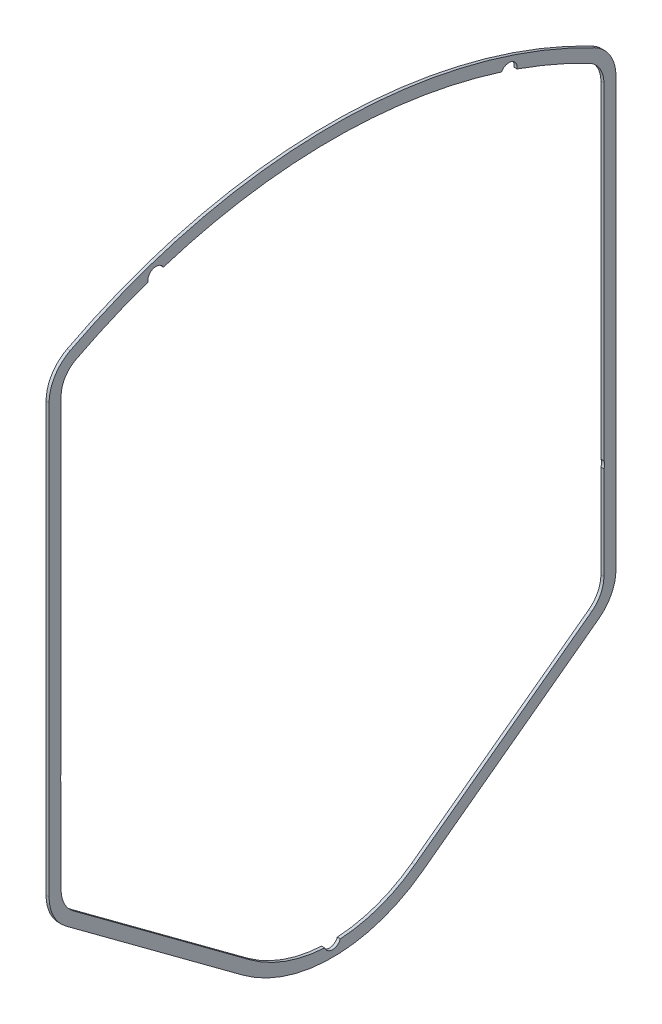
ISO-10303-21;
HEADER;
FILE_DESCRIPTION(('STEP AP214'),'2;1');
FILE_NAME('part.step','',(''),(''),'','','');
FILE_SCHEMA(('AUTOMOTIVE_DESIGN { 1 0 10303 214 1 1 1 1 }'));
ENDSEC;
DATA;
#1=APPLICATION_CONTEXT('core data for automotive mechanical design processes');
#2=APPLICATION_PROTOCOL_DEFINITION('international standard','automotive_design',2000,#1);
#3=PRODUCT_CONTEXT('',#1,'mechanical');
#4=PRODUCT('Part','Part','',(#3));
#5=PRODUCT_RELATED_PRODUCT_CATEGORY('part','',(#4));
#6=PRODUCT_DEFINITION_FORMATION('','',#4);
#7=PRODUCT_DEFINITION_CONTEXT('part definition',#1,'design');
#8=PRODUCT_DEFINITION('design','',#6,#7);
#9=PRODUCT_DEFINITION_SHAPE('','',#8);
#10=(LENGTH_UNIT() NAMED_UNIT(*) SI_UNIT(.MILLI.,.METRE.));
#11=(NAMED_UNIT(*) PLANE_ANGLE_UNIT() SI_UNIT($,.RADIAN.));
#12=(NAMED_UNIT(*) SI_UNIT($,.STERADIAN.) SOLID_ANGLE_UNIT());
#13=UNCERTAINTY_MEASURE_WITH_UNIT(LENGTH_MEASURE(1.E-05),#10,'distance_accuracy_value','');
#14=(GEOMETRIC_REPRESENTATION_CONTEXT(3) GLOBAL_UNCERTAINTY_ASSIGNED_CONTEXT((#13)) GLOBAL_UNIT_ASSIGNED_CONTEXT((#10,
#11,#12)) REPRESENTATION_CONTEXT('',''));
#15=CARTESIAN_POINT('',(0.,0.,0.));
#16=DIRECTION('',(0.,0.,1.));
#17=DIRECTION('',(1.,0.,0.));
#18=AXIS2_PLACEMENT_3D('',#15,#16,#17);
#19=CARTESIAN_POINT('',(1.,156.2529999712,80.9999999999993));
#20=DIRECTION('',(1.,0.,0.));
#21=DIRECTION('',(0.,0.,-1.));
#22=AXIS2_PLACEMENT_3D('',#19,#20,#21);
#23=PLANE('',#22);
#24=CARTESIAN_POINT('',(1.,156.2529999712,80.9999999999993));
#25=DIRECTION('',(1.,0.,0.));
#26=DIRECTION('',(0.,0.,-1.));
#27=AXIS2_PLACEMENT_3D('',#24,#25,#26);
#28=CIRCLE('',#27,13.);
#29=CARTESIAN_POINT('',(1.,167.7944147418,86.9829545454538));
#30=VERTEX_POINT('',#29);
#31=CARTESIAN_POINT('',(1.,156.2529999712,93.9999999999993));
#32=VERTEX_POINT('',#31);
#33=EDGE_CURVE('E392',#30,#32,#28,.T.);
#34=ORIENTED_EDGE('',*,*,#33,.T.);
#35=DIRECTION('',(0.,-1.,0.));
#36=VECTOR('',#35,1.);
#37=CARTESIAN_POINT('',(1.,14.4127935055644,93.9999999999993));
#38=LINE('',#37,#36);
#39=CARTESIAN_POINT('',(1.,14.4127935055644,93.9999999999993));
#40=VERTEX_POINT('',#39);
#41=EDGE_CURVE('E395',#32,#40,#38,.T.);
#42=ORIENTED_EDGE('',*,*,#41,.T.);
#43=CARTESIAN_POINT('',(1.,14.4127935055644,79.9999999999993));
#44=DIRECTION('',(1.,0.,0.));
#45=DIRECTION('',(0.,0.,-1.));
#46=AXIS2_PLACEMENT_3D('',#43,#44,#45);
#47=CIRCLE('',#46,14.);
#48=CARTESIAN_POINT('',(1.,3.15879745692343,88.3275190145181));
#49=VERTEX_POINT('',#48);
#50=EDGE_CURVE('E397',#40,#49,#47,.T.);
#51=ORIENTED_EDGE('',*,*,#50,.T.);
#52=DIRECTION('',(0.,-0.594822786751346,-0.803856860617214));
#53=VECTOR('',#52,1.);
#54=CARTESIAN_POINT('',(1.,-40.1928430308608,29.7411393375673));
#55=LINE('',#54,#53);
#56=CARTESIAN_POINT('',(1.,-40.1928430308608,29.7411393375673));
#57=VERTEX_POINT('',#56);
#58=EDGE_CURVE('E399',#49,#57,#55,.T.);
#59=ORIENTED_EDGE('',*,*,#58,.T.);
#60=CARTESIAN_POINT('',(1.,0.,0.));
#61=DIRECTION('',(1.,0.,0.));
#62=DIRECTION('',(0.,0.,-1.));
#63=AXIS2_PLACEMENT_3D('',#60,#61,#62);
#64=CIRCLE('',#63,50.);
#65=CARTESIAN_POINT('',(1.,-40.1928430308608,-29.7411393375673));
#66=VERTEX_POINT('',#65);
#67=EDGE_CURVE('E401',#57,#66,#64,.T.);
#68=ORIENTED_EDGE('',*,*,#67,.T.);
#69=DIRECTION('',(0.,0.594822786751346,-0.803856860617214));
#70=VECTOR('',#69,1.);
#71=CARTESIAN_POINT('',(1.,-40.1928430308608,-29.7411393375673));
#72=LINE('',#71,#70);
#73=CARTESIAN_POINT('',(1.,3.15879745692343,-88.3275190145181));
#74=VERTEX_POINT('',#73);
#75=EDGE_CURVE('E403',#66,#74,#72,.T.);
#76=ORIENTED_EDGE('',*,*,#75,.T.);
#77=CARTESIAN_POINT('',(1.,14.4127935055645,-79.9999999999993));
#78=DIRECTION('',(1.,0.,0.));
#79=DIRECTION('',(0.,0.,-1.));
#80=AXIS2_PLACEMENT_3D('',#77,#78,#79);
#81=CIRCLE('',#80,14.);
#82=CARTESIAN_POINT('',(1.,14.4127935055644,-93.9999999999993));
#83=VERTEX_POINT('',#82);
#84=EDGE_CURVE('E405',#74,#83,#81,.T.);
#85=ORIENTED_EDGE('',*,*,#84,.T.);
#86=DIRECTION('',(0.,1.,0.));
#87=VECTOR('',#86,1.);
#88=CARTESIAN_POINT('',(1.,14.4127935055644,-93.9999999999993));
#89=LINE('',#88,#87);
#90=CARTESIAN_POINT('',(1.,156.2529999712,-93.9999999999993));
#91=VERTEX_POINT('',#90);
#92=EDGE_CURVE('E407',#83,#91,#89,.T.);
#93=ORIENTED_EDGE('',*,*,#92,.T.);
#94=CARTESIAN_POINT('',(1.,156.2529999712,-80.9999999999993));
#95=DIRECTION('',(1.,0.,0.));
#96=DIRECTION('',(0.,0.,-1.));
#97=AXIS2_PLACEMENT_3D('',#94,#95,#96);
#98=CIRCLE('',#97,13.);
#99=CARTESIAN_POINT('',(1.,167.7944147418,-86.9829545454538));
#100=VERTEX_POINT('',#99);
#101=EDGE_CURVE('E409',#91,#100,#98,.T.);
#102=ORIENTED_EDGE('',*,*,#101,.T.);
#103=CARTESIAN_POINT('',(1.,0.,0.));
#104=DIRECTION('',(1.,0.,0.));
#105=DIRECTION('',(0.,0.,-1.));
#106=AXIS2_PLACEMENT_3D('',#103,#104,#105);
#107=CIRCLE('',#106,188.999999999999);
#108=EDGE_CURVE('E411',#100,#30,#107,.T.);
#109=ORIENTED_EDGE('',*,*,#108,.T.);
#110=EDGE_LOOP('',(#34,#42,#51,#59,#68,#76,#85,#93,#102,#109));
#111=FACE_BOUND('',#110,.T.);
#112=CARTESIAN_POINT('',(1.,-45.,0.));
#113=DIRECTION('',(1.,0.,0.));
#114=DIRECTION('',(0.,0.,-1.));
#115=AXIS2_PLACEMENT_3D('',#112,#113,#114);
#116=CIRCLE('',#115,2.75);
#117=CARTESIAN_POINT('',(1.,-45.9270833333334,2.5890184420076));
#118=VERTEX_POINT('',#117);
#119=CARTESIAN_POINT('',(1.,-45.9270833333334,-2.58901844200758));
#120=VERTEX_POINT('',#119);
#121=EDGE_CURVE('E298',#118,#120,#116,.T.);
#122=ORIENTED_EDGE('',*,*,#121,.F.);
#123=CARTESIAN_POINT('',(1.,0.,0.));
#124=DIRECTION('',(1.,0.,0.));
#125=DIRECTION('',(0.,0.,-1.));
#126=AXIS2_PLACEMENT_3D('',#123,#124,#125);
#127=CIRCLE('',#126,46.0000000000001);
#128=CARTESIAN_POINT('',(1.,-36.9774155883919,27.3618481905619));
#129=VERTEX_POINT('',#128);
#130=EDGE_CURVE('E239',#129,#118,#127,.T.);
#131=ORIENTED_EDGE('',*,*,#130,.F.);
#132=DIRECTION('',(0.,-0.594822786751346,-0.803856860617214));
#133=VECTOR('',#132,1.);
#134=CARTESIAN_POINT('',(1.,-36.9774155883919,27.3618481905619));
#135=LINE('',#134,#133);
#136=CARTESIAN_POINT('',(1.,6.37422489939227,85.9482278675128));
#137=VERTEX_POINT('',#136);
#138=EDGE_CURVE('E334',#137,#129,#135,.T.);
#139=ORIENTED_EDGE('',*,*,#138,.F.);
#140=CARTESIAN_POINT('',(1.,14.4127935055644,79.9999999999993));
#141=DIRECTION('',(1.,0.,0.));
#142=DIRECTION('',(0.,0.,-1.));
#143=AXIS2_PLACEMENT_3D('',#140,#141,#142);
#144=CIRCLE('',#143,9.99999999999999);
#145=CARTESIAN_POINT('',(1.,14.4127935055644,89.9999999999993));
#146=VERTEX_POINT('',#145);
#147=EDGE_CURVE('E332',#146,#137,#144,.T.);
#148=ORIENTED_EDGE('',*,*,#147,.F.);
#149=DIRECTION('',(0.,-1.,0.));
#150=VECTOR('',#149,1.);
#151=CARTESIAN_POINT('',(1.,14.4127935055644,89.9999999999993));
#152=LINE('',#151,#150);
#153=CARTESIAN_POINT('',(1.,45.3543560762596,89.9999999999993));
#154=VERTEX_POINT('',#153);
#155=EDGE_CURVE('E330',#154,#146,#152,.T.);
#156=ORIENTED_EDGE('',*,*,#155,.F.);
#157=CARTESIAN_POINT('',(1.,46.5,87.5));
#158=DIRECTION('',(1.,0.,0.));
#159=DIRECTION('',(0.,0.,-1.));
#160=AXIS2_PLACEMENT_3D('',#157,#158,#159);
#161=CIRCLE('',#160,2.75);
#162=CARTESIAN_POINT('',(1.,47.6456439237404,89.9999999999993));
#163=VERTEX_POINT('',#162);
#164=EDGE_CURVE('E328',#163,#154,#161,.T.);
#165=ORIENTED_EDGE('',*,*,#164,.F.);
#166=DIRECTION('',(0.,-1.,0.));
#167=VECTOR('',#166,1.);
#168=CARTESIAN_POINT('',(1.,47.6456439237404,89.9999999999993));
#169=LINE('',#168,#167);
#170=CARTESIAN_POINT('',(1.,156.2529999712,89.9999999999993));
#171=VERTEX_POINT('',#170);
#172=EDGE_CURVE('E326',#171,#163,#169,.T.);
#173=ORIENTED_EDGE('',*,*,#172,.F.);
#174=CARTESIAN_POINT('',(1.,156.2529999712,80.9999999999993));
#175=DIRECTION('',(1.,0.,0.));
#176=DIRECTION('',(0.,0.,-1.));
#177=AXIS2_PLACEMENT_3D('',#174,#175,#176);
#178=CIRCLE('',#177,9.00000000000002);
#179=CARTESIAN_POINT('',(1.,164.243210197,85.1420454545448));
#180=VERTEX_POINT('',#179);
#181=EDGE_CURVE('E324',#180,#171,#178,.T.);
#182=ORIENTED_EDGE('',*,*,#181,.F.);
#183=CARTESIAN_POINT('',(1.,0.,0.));
#184=DIRECTION('',(1.,0.,0.));
#185=DIRECTION('',(0.,0.,-1.));
#186=AXIS2_PLACEMENT_3D('',#183,#184,#185);
#187=CIRCLE('',#186,184.999999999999);
#188=CARTESIAN_POINT('',(1.,174.57785985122,61.2174064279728));
#189=VERTEX_POINT('',#188);
#190=EDGE_CURVE('E322',#189,#180,#187,.T.);
#191=ORIENTED_EDGE('',*,*,#190,.F.);
#192=CARTESIAN_POINT('',(1.,175.,58.5));
#193=DIRECTION('',(1.,0.,0.));
#194=DIRECTION('',(0.,0.,-1.));
#195=AXIS2_PLACEMENT_3D('',#192,#193,#194);
#196=CIRCLE('',#195,2.75000000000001);
#197=CARTESIAN_POINT('',(1.,176.296889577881,56.0750098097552));
#198=VERTEX_POINT('',#197);
#199=EDGE_CURVE('E320',#198,#189,#196,.T.);
#200=ORIENTED_EDGE('',*,*,#199,.F.);
#201=CARTESIAN_POINT('',(1.,0.,0.));
#202=DIRECTION('',(1.,0.,0.));
#203=DIRECTION('',(0.,0.,-1.));
#204=AXIS2_PLACEMENT_3D('',#201,#202,#203);
#205=CIRCLE('',#204,184.999999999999);
#206=CARTESIAN_POINT('',(1.,176.296889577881,-56.0750098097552));
#207=VERTEX_POINT('',#206);
#208=EDGE_CURVE('E318',#207,#198,#205,.T.);
#209=ORIENTED_EDGE('',*,*,#208,.F.);
#210=CARTESIAN_POINT('',(1.,175.,-58.5));
#211=DIRECTION('',(1.,0.,0.));
#212=DIRECTION('',(0.,0.,-1.));
#213=AXIS2_PLACEMENT_3D('',#210,#211,#212);
#214=CIRCLE('',#213,2.75000000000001);
#215=CARTESIAN_POINT('',(1.,174.57785985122,-61.2174064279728));
#216=VERTEX_POINT('',#215);
#217=EDGE_CURVE('E316',#216,#207,#214,.T.);
#218=ORIENTED_EDGE('',*,*,#217,.F.);
#219=CARTESIAN_POINT('',(1.,0.,0.));
#220=DIRECTION('',(1.,0.,0.));
#221=DIRECTION('',(0.,0.,-1.));
#222=AXIS2_PLACEMENT_3D('',#219,#220,#221);
#223=CIRCLE('',#222,184.999999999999);
#224=CARTESIAN_POINT('',(1.,164.243210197,-85.1420454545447));
#225=VERTEX_POINT('',#224);
#226=EDGE_CURVE('E314',#225,#216,#223,.T.);
#227=ORIENTED_EDGE('',*,*,#226,.F.);
#228=CARTESIAN_POINT('',(1.,156.2529999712,-80.9999999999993));
#229=DIRECTION('',(1.,0.,0.));
#230=DIRECTION('',(0.,0.,-1.));
#231=AXIS2_PLACEMENT_3D('',#228,#229,#230);
#232=CIRCLE('',#231,8.99999999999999);
#233=CARTESIAN_POINT('',(1.,156.2529999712,-89.9999999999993));
#234=VERTEX_POINT('',#233);
#235=EDGE_CURVE('E312',#234,#225,#232,.T.);
#236=ORIENTED_EDGE('',*,*,#235,.F.);
#237=DIRECTION('',(0.,1.,0.));
#238=VECTOR('',#237,1.);
#239=CARTESIAN_POINT('',(1.,47.6456439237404,-89.9999999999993));
#240=LINE('',#239,#238);
#241=CARTESIAN_POINT('',(1.,47.6456439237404,-89.9999999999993));
#242=VERTEX_POINT('',#241);
#243=EDGE_CURVE('E310',#242,#234,#240,.T.);
#244=ORIENTED_EDGE('',*,*,#243,.F.);
#245=CARTESIAN_POINT('',(1.,46.4999999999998,-87.5));
#246=DIRECTION('',(1.,0.,0.));
#247=DIRECTION('',(0.,0.,1.));
#248=AXIS2_PLACEMENT_3D('',#245,#246,#247);
#249=CIRCLE('',#248,2.75);
#250=CARTESIAN_POINT('',(1.,45.3543560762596,-89.9999999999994));
#251=VERTEX_POINT('',#250);
#252=EDGE_CURVE('E308',#251,#242,#249,.T.);
#253=ORIENTED_EDGE('',*,*,#252,.F.);
#254=DIRECTION('',(0.,1.,0.));
#255=VECTOR('',#254,1.);
#256=CARTESIAN_POINT('',(1.,14.4127935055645,-89.9999999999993));
#257=LINE('',#256,#255);
#258=CARTESIAN_POINT('',(1.,14.4127935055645,-89.9999999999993));
#259=VERTEX_POINT('',#258);
#260=EDGE_CURVE('E306',#259,#251,#257,.T.);
#261=ORIENTED_EDGE('',*,*,#260,.F.);
#262=CARTESIAN_POINT('',(1.,14.4127935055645,-79.9999999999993));
#263=DIRECTION('',(1.,0.,0.));
#264=DIRECTION('',(0.,0.,-1.));
#265=AXIS2_PLACEMENT_3D('',#262,#263,#264);
#266=CIRCLE('',#265,10.);
#267=CARTESIAN_POINT('',(1.,6.37422489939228,-85.9482278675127));
#268=VERTEX_POINT('',#267);
#269=EDGE_CURVE('E304',#268,#259,#266,.T.);
#270=ORIENTED_EDGE('',*,*,#269,.F.);
#271=DIRECTION('',(0.,0.594822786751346,-0.803856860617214));
#272=VECTOR('',#271,1.);
#273=CARTESIAN_POINT('',(1.,-36.9774155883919,-27.3618481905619));
#274=LINE('',#273,#272);
#275=CARTESIAN_POINT('',(1.,-36.9774155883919,-27.3618481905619));
#276=VERTEX_POINT('',#275);
#277=EDGE_CURVE('E302',#276,#268,#274,.T.);
#278=ORIENTED_EDGE('',*,*,#277,.F.);
#279=CARTESIAN_POINT('',(1.,0.,0.));
#280=DIRECTION('',(1.,0.,0.));
#281=DIRECTION('',(0.,0.,-1.));
#282=AXIS2_PLACEMENT_3D('',#279,#280,#281);
#283=CIRCLE('',#282,46.0000000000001);
#284=EDGE_CURVE('E300',#120,#276,#283,.T.);
#285=ORIENTED_EDGE('',*,*,#284,.F.);
#286=EDGE_LOOP('',(#122,#131,#139,#148,#156,#165,#173,#182,#191,#200,#209,#218,#227,#236,#244,
#253,#261,#270,#278,#285));
#287=FACE_BOUND('',#286,.T.);
#288=ADVANCED_FACE('F27',(#111,#287),#23,.T.);
#289=CARTESIAN_POINT('',(0.,156.2529999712,80.9999999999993));
#290=DIRECTION('',(1.,0.,0.));
#291=DIRECTION('',(0.,0.,-1.));
#292=AXIS2_PLACEMENT_3D('',#289,#290,#291);
#293=PLANE('',#292);
#294=CARTESIAN_POINT('',(0.,156.2529999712,80.9999999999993));
#295=DIRECTION('',(1.,0.,0.));
#296=DIRECTION('',(0.,0.,-1.));
#297=AXIS2_PLACEMENT_3D('',#294,#295,#296);
#298=CIRCLE('',#297,13.);
#299=CARTESIAN_POINT('',(0.,167.7944147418,86.9829545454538));
#300=VERTEX_POINT('',#299);
#301=CARTESIAN_POINT('',(0.,156.2529999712,93.9999999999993));
#302=VERTEX_POINT('',#301);
#303=EDGE_CURVE('E240',#300,#302,#298,.T.);
#304=ORIENTED_EDGE('',*,*,#303,.F.);
#305=CARTESIAN_POINT('',(0.,0.,0.));
#306=DIRECTION('',(1.,0.,0.));
#307=DIRECTION('',(0.,0.,-1.));
#308=AXIS2_PLACEMENT_3D('',#305,#306,#307);
#309=CIRCLE('',#308,188.999999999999);
#310=CARTESIAN_POINT('',(0.,167.7944147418,-86.9829545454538));
#311=VERTEX_POINT('',#310);
#312=EDGE_CURVE('E390',#311,#300,#309,.T.);
#313=ORIENTED_EDGE('',*,*,#312,.F.);
#314=CARTESIAN_POINT('',(0.,156.2529999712,-80.9999999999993));
#315=DIRECTION('',(1.,0.,0.));
#316=DIRECTION('',(0.,0.,-1.));
#317=AXIS2_PLACEMENT_3D('',#314,#315,#316);
#318=CIRCLE('',#317,13.);
#319=CARTESIAN_POINT('',(0.,156.2529999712,-93.9999999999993));
#320=VERTEX_POINT('',#319);
#321=EDGE_CURVE('E388',#320,#311,#318,.T.);
#322=ORIENTED_EDGE('',*,*,#321,.F.);
#323=DIRECTION('',(0.,1.,0.));
#324=VECTOR('',#323,1.);
#325=CARTESIAN_POINT('',(0.,14.4127935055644,-93.9999999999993));
#326=LINE('',#325,#324);
#327=CARTESIAN_POINT('',(0.,14.4127935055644,-93.9999999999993));
#328=VERTEX_POINT('',#327);
#329=EDGE_CURVE('E386',#328,#320,#326,.T.);
#330=ORIENTED_EDGE('',*,*,#329,.F.);
#331=CARTESIAN_POINT('',(0.,14.4127935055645,-79.9999999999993));
#332=DIRECTION('',(1.,0.,0.));
#333=DIRECTION('',(0.,0.,-1.));
#334=AXIS2_PLACEMENT_3D('',#331,#332,#333);
#335=CIRCLE('',#334,14.);
#336=CARTESIAN_POINT('',(0.,3.15879745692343,-88.3275190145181));
#337=VERTEX_POINT('',#336);
#338=EDGE_CURVE('E384',#337,#328,#335,.T.);
#339=ORIENTED_EDGE('',*,*,#338,.F.);
#340=DIRECTION('',(0.,0.594822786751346,-0.803856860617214));
#341=VECTOR('',#340,1.);
#342=CARTESIAN_POINT('',(0.,-40.1928430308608,-29.7411393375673));
#343=LINE('',#342,#341);
#344=CARTESIAN_POINT('',(0.,-40.1928430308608,-29.7411393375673));
#345=VERTEX_POINT('',#344);
#346=EDGE_CURVE('E382',#345,#337,#343,.T.);
#347=ORIENTED_EDGE('',*,*,#346,.F.);
#348=CARTESIAN_POINT('',(0.,0.,0.));
#349=DIRECTION('',(1.,0.,0.));
#350=DIRECTION('',(0.,0.,-1.));
#351=AXIS2_PLACEMENT_3D('',#348,#349,#350);
#352=CIRCLE('',#351,50.);
#353=CARTESIAN_POINT('',(0.,-40.1928430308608,29.7411393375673));
#354=VERTEX_POINT('',#353);
#355=EDGE_CURVE('E380',#354,#345,#352,.T.);
#356=ORIENTED_EDGE('',*,*,#355,.F.);
#357=DIRECTION('',(0.,-0.594822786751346,-0.803856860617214));
#358=VECTOR('',#357,1.);
#359=CARTESIAN_POINT('',(0.,-40.1928430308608,29.7411393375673));
#360=LINE('',#359,#358);
#361=CARTESIAN_POINT('',(0.,3.15879745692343,88.3275190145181));
#362=VERTEX_POINT('',#361);
#363=EDGE_CURVE('E378',#362,#354,#360,.T.);
#364=ORIENTED_EDGE('',*,*,#363,.F.);
#365=CARTESIAN_POINT('',(0.,14.4127935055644,79.9999999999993));
#366=DIRECTION('',(1.,0.,0.));
#367=DIRECTION('',(0.,0.,-1.));
#368=AXIS2_PLACEMENT_3D('',#365,#366,#367);
#369=CIRCLE('',#368,14.);
#370=CARTESIAN_POINT('',(0.,14.4127935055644,93.9999999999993));
#371=VERTEX_POINT('',#370);
#372=EDGE_CURVE('E376',#371,#362,#369,.T.);
#373=ORIENTED_EDGE('',*,*,#372,.F.);
#374=DIRECTION('',(0.,-1.,0.));
#375=VECTOR('',#374,1.);
#376=CARTESIAN_POINT('',(0.,14.4127935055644,93.9999999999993));
#377=LINE('',#376,#375);
#378=EDGE_CURVE('E374',#302,#371,#377,.T.);
#379=ORIENTED_EDGE('',*,*,#378,.F.);
#380=EDGE_LOOP('',(#304,#313,#322,#330,#339,#347,#356,#364,#373,#379));
#381=FACE_BOUND('',#380,.T.);
#382=CARTESIAN_POINT('',(0.,0.,0.));
#383=DIRECTION('',(1.,0.,0.));
#384=DIRECTION('',(0.,0.,-1.));
#385=AXIS2_PLACEMENT_3D('',#382,#383,#384);
#386=CIRCLE('',#385,46.0000000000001);
#387=CARTESIAN_POINT('',(0.,-36.9774155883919,27.361848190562));
#388=VERTEX_POINT('',#387);
#389=CARTESIAN_POINT('',(0.,-45.9270833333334,2.5890184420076));
#390=VERTEX_POINT('',#389);
#391=EDGE_CURVE('E50',#388,#390,#386,.T.);
#392=ORIENTED_EDGE('',*,*,#391,.T.);
#393=CARTESIAN_POINT('',(0.,-45.,0.));
#394=DIRECTION('',(1.,0.,0.));
#395=DIRECTION('',(0.,0.,-1.));
#396=AXIS2_PLACEMENT_3D('',#393,#394,#395);
#397=CIRCLE('',#396,2.75);
#398=CARTESIAN_POINT('',(0.,-45.9270833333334,-2.58901844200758));
#399=VERTEX_POINT('',#398);
#400=EDGE_CURVE('E226',#390,#399,#397,.T.);
#401=ORIENTED_EDGE('',*,*,#400,.T.);
#402=CARTESIAN_POINT('',(0.,0.,0.));
#403=DIRECTION('',(1.,0.,0.));
#404=DIRECTION('',(0.,0.,-1.));
#405=AXIS2_PLACEMENT_3D('',#402,#403,#404);
#406=CIRCLE('',#405,46.0000000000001);
#407=CARTESIAN_POINT('',(0.,-36.9774155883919,-27.3618481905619));
#408=VERTEX_POINT('',#407);
#409=EDGE_CURVE('E235',#399,#408,#406,.T.);
#410=ORIENTED_EDGE('',*,*,#409,.T.);
#411=DIRECTION('',(0.,0.594822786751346,-0.803856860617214));
#412=VECTOR('',#411,1.);
#413=CARTESIAN_POINT('',(0.,-36.9774155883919,-27.3618481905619));
#414=LINE('',#413,#412);
#415=CARTESIAN_POINT('',(0.,6.37422489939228,-85.9482278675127));
#416=VERTEX_POINT('',#415);
#417=EDGE_CURVE('E249',#408,#416,#414,.T.);
#418=ORIENTED_EDGE('',*,*,#417,.T.);
#419=CARTESIAN_POINT('',(0.,14.4127935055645,-79.9999999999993));
#420=DIRECTION('',(1.,0.,0.));
#421=DIRECTION('',(0.,0.,-1.));
#422=AXIS2_PLACEMENT_3D('',#419,#420,#421);
#423=CIRCLE('',#422,10.);
#424=CARTESIAN_POINT('',(0.,14.4127935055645,-89.9999999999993));
#425=VERTEX_POINT('',#424);
#426=EDGE_CURVE('E252',#416,#425,#423,.T.);
#427=ORIENTED_EDGE('',*,*,#426,.T.);
#428=DIRECTION('',(0.,1.,0.));
#429=VECTOR('',#428,1.);
#430=CARTESIAN_POINT('',(0.,14.4127935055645,-89.9999999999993));
#431=LINE('',#430,#429);
#432=CARTESIAN_POINT('',(0.,45.3543560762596,-89.9999999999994));
#433=VERTEX_POINT('',#432);
#434=EDGE_CURVE('E255',#425,#433,#431,.T.);
#435=ORIENTED_EDGE('',*,*,#434,.T.);
#436=CARTESIAN_POINT('',(0.,46.4999999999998,-87.5));
#437=DIRECTION('',(1.,0.,0.));
#438=DIRECTION('',(0.,0.,1.));
#439=AXIS2_PLACEMENT_3D('',#436,#437,#438);
#440=CIRCLE('',#439,2.75);
#441=CARTESIAN_POINT('',(0.,47.6456439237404,-89.9999999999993));
#442=VERTEX_POINT('',#441);
#443=EDGE_CURVE('E258',#433,#442,#440,.T.);
#444=ORIENTED_EDGE('',*,*,#443,.T.);
#445=DIRECTION('',(0.,1.,0.));
#446=VECTOR('',#445,1.);
#447=CARTESIAN_POINT('',(0.,47.6456439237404,-89.9999999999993));
#448=LINE('',#447,#446);
#449=CARTESIAN_POINT('',(0.,156.2529999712,-89.9999999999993));
#450=VERTEX_POINT('',#449);
#451=EDGE_CURVE('E261',#442,#450,#448,.T.);
#452=ORIENTED_EDGE('',*,*,#451,.T.);
#453=CARTESIAN_POINT('',(0.,156.2529999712,-80.9999999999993));
#454=DIRECTION('',(1.,0.,0.));
#455=DIRECTION('',(0.,0.,-1.));
#456=AXIS2_PLACEMENT_3D('',#453,#454,#455);
#457=CIRCLE('',#456,8.99999999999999);
#458=CARTESIAN_POINT('',(0.,164.243210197,-85.1420454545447));
#459=VERTEX_POINT('',#458);
#460=EDGE_CURVE('E264',#450,#459,#457,.T.);
#461=ORIENTED_EDGE('',*,*,#460,.T.);
#462=CARTESIAN_POINT('',(0.,0.,0.));
#463=DIRECTION('',(1.,0.,0.));
#464=DIRECTION('',(0.,0.,-1.));
#465=AXIS2_PLACEMENT_3D('',#462,#463,#464);
#466=CIRCLE('',#465,184.999999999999);
#467=CARTESIAN_POINT('',(0.,174.57785985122,-61.2174064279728));
#468=VERTEX_POINT('',#467);
#469=EDGE_CURVE('E267',#459,#468,#466,.T.);
#470=ORIENTED_EDGE('',*,*,#469,.T.);
#471=CARTESIAN_POINT('',(0.,175.,-58.5));
#472=DIRECTION('',(1.,0.,0.));
#473=DIRECTION('',(0.,0.,-1.));
#474=AXIS2_PLACEMENT_3D('',#471,#472,#473);
#475=CIRCLE('',#474,2.75000000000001);
#476=CARTESIAN_POINT('',(0.,176.296889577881,-56.0750098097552));
#477=VERTEX_POINT('',#476);
#478=EDGE_CURVE('E270',#468,#477,#475,.T.);
#479=ORIENTED_EDGE('',*,*,#478,.T.);
#480=CARTESIAN_POINT('',(0.,0.,0.));
#481=DIRECTION('',(1.,0.,0.));
#482=DIRECTION('',(0.,0.,-1.));
#483=AXIS2_PLACEMENT_3D('',#480,#481,#482);
#484=CIRCLE('',#483,184.999999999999);
#485=CARTESIAN_POINT('',(0.,176.296889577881,56.0750098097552));
#486=VERTEX_POINT('',#485);
#487=EDGE_CURVE('E273',#477,#486,#484,.T.);
#488=ORIENTED_EDGE('',*,*,#487,.T.);
#489=CARTESIAN_POINT('',(0.,175.,58.5));
#490=DIRECTION('',(1.,0.,0.));
#491=DIRECTION('',(0.,0.,-1.));
#492=AXIS2_PLACEMENT_3D('',#489,#490,#491);
#493=CIRCLE('',#492,2.75000000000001);
#494=CARTESIAN_POINT('',(0.,174.57785985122,61.2174064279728));
#495=VERTEX_POINT('',#494);
#496=EDGE_CURVE('E276',#486,#495,#493,.T.);
#497=ORIENTED_EDGE('',*,*,#496,.T.);
#498=CARTESIAN_POINT('',(0.,0.,0.));
#499=DIRECTION('',(1.,0.,0.));
#500=DIRECTION('',(0.,0.,-1.));
#501=AXIS2_PLACEMENT_3D('',#498,#499,#500);
#502=CIRCLE('',#501,184.999999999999);
#503=CARTESIAN_POINT('',(0.,164.243210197,85.1420454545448));
#504=VERTEX_POINT('',#503);
#505=EDGE_CURVE('E279',#495,#504,#502,.T.);
#506=ORIENTED_EDGE('',*,*,#505,.T.);
#507=CARTESIAN_POINT('',(0.,156.2529999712,80.9999999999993));
#508=DIRECTION('',(1.,0.,0.));
#509=DIRECTION('',(0.,0.,-1.));
#510=AXIS2_PLACEMENT_3D('',#507,#508,#509);
#511=CIRCLE('',#510,9.00000000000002);
#512=CARTESIAN_POINT('',(0.,156.2529999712,89.9999999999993));
#513=VERTEX_POINT('',#512);
#514=EDGE_CURVE('E282',#504,#513,#511,.T.);
#515=ORIENTED_EDGE('',*,*,#514,.T.);
#516=DIRECTION('',(0.,-1.,0.));
#517=VECTOR('',#516,1.);
#518=CARTESIAN_POINT('',(0.,47.6456439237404,89.9999999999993));
#519=LINE('',#518,#517);
#520=CARTESIAN_POINT('',(0.,47.6456439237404,89.9999999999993));
#521=VERTEX_POINT('',#520);
#522=EDGE_CURVE('E285',#513,#521,#519,.T.);
#523=ORIENTED_EDGE('',*,*,#522,.T.);
#524=CARTESIAN_POINT('',(0.,46.5,87.5));
#525=DIRECTION('',(1.,0.,0.));
#526=DIRECTION('',(0.,0.,-1.));
#527=AXIS2_PLACEMENT_3D('',#524,#525,#526);
#528=CIRCLE('',#527,2.75);
#529=CARTESIAN_POINT('',(0.,45.3543560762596,89.9999999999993));
#530=VERTEX_POINT('',#529);
#531=EDGE_CURVE('E288',#521,#530,#528,.T.);
#532=ORIENTED_EDGE('',*,*,#531,.T.);
#533=DIRECTION('',(0.,-1.,0.));
#534=VECTOR('',#533,1.);
#535=CARTESIAN_POINT('',(0.,14.4127935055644,89.9999999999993));
#536=LINE('',#535,#534);
#537=CARTESIAN_POINT('',(0.,14.4127935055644,89.9999999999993));
#538=VERTEX_POINT('',#537);
#539=EDGE_CURVE('E291',#530,#538,#536,.T.);
#540=ORIENTED_EDGE('',*,*,#539,.T.);
#541=CARTESIAN_POINT('',(0.,14.4127935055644,79.9999999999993));
#542=DIRECTION('',(1.,0.,0.));
#543=DIRECTION('',(0.,0.,-1.));
#544=AXIS2_PLACEMENT_3D('',#541,#542,#543);
#545=CIRCLE('',#544,9.99999999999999);
#546=CARTESIAN_POINT('',(0.,6.3742248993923,85.9482278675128));
#547=VERTEX_POINT('',#546);
#548=EDGE_CURVE('E294',#538,#547,#545,.T.);
#549=ORIENTED_EDGE('',*,*,#548,.T.);
#550=DIRECTION('',(0.,-0.594822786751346,-0.803856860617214));
#551=VECTOR('',#550,1.);
#552=CARTESIAN_POINT('',(0.,-36.9774155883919,27.3618481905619));
#553=LINE('',#552,#551);
#554=EDGE_CURVE('E245',#547,#388,#553,.T.);
#555=ORIENTED_EDGE('',*,*,#554,.T.);
#556=EDGE_LOOP('',(#392,#401,#410,#418,#427,#435,#444,#452,#461,#470,#479,#488,#497,#506,#515,
#523,#532,#540,#549,#555));
#557=FACE_BOUND('',#556,.T.);
#558=ADVANCED_FACE('F243',(#381,#557),#293,.F.);
#559=CARTESIAN_POINT('',(1.,156.2529999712,80.9999999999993));
#560=DIRECTION('',(-1.,0.,0.));
#561=DIRECTION('',(0.,0.,1.));
#562=AXIS2_PLACEMENT_3D('',#559,#560,#561);
#563=CYLINDRICAL_SURFACE('',#562,13.);
#564=ORIENTED_EDGE('',*,*,#303,.T.);
#565=DIRECTION('',(-1.,0.,0.));
#566=VECTOR('',#565,1.);
#567=CARTESIAN_POINT('',(1.,156.2529999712,93.9999999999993));
#568=LINE('',#567,#566);
#569=EDGE_CURVE('E11',#32,#302,#568,.T.);
#570=ORIENTED_EDGE('',*,*,#569,.F.);
#571=ORIENTED_EDGE('',*,*,#33,.F.);
#572=DIRECTION('',(-1.,0.,0.));
#573=VECTOR('',#572,1.);
#574=CARTESIAN_POINT('',(1.,167.7944147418,86.9829545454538));
#575=LINE('',#574,#573);
#576=EDGE_CURVE('E413',#30,#300,#575,.T.);
#577=ORIENTED_EDGE('',*,*,#576,.T.);
#578=EDGE_LOOP('',(#564,#570,#571,#577));
#579=FACE_BOUND('',#578,.T.);
#580=ADVANCED_FACE('F29',(#579),#563,.T.);
#581=CARTESIAN_POINT('',(1.,14.4127935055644,93.9999999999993));
#582=DIRECTION('',(0.,0.,-1.));
#583=DIRECTION('',(-1.,0.,0.));
#584=AXIS2_PLACEMENT_3D('',#581,#582,#583);
#585=PLANE('',#584);
#586=ORIENTED_EDGE('',*,*,#378,.T.);
#587=DIRECTION('',(-1.,0.,0.));
#588=VECTOR('',#587,1.);
#589=CARTESIAN_POINT('',(1.,14.4127935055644,93.9999999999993));
#590=LINE('',#589,#588);
#591=EDGE_CURVE('E35',#40,#371,#590,.T.);
#592=ORIENTED_EDGE('',*,*,#591,.F.);
#593=ORIENTED_EDGE('',*,*,#41,.F.);
#594=ORIENTED_EDGE('',*,*,#569,.T.);
#595=EDGE_LOOP('',(#586,#592,#593,#594));
#596=FACE_BOUND('',#595,.T.);
#597=ADVANCED_FACE('F463',(#596),#585,.F.);
#598=CARTESIAN_POINT('',(1.,14.4127935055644,79.9999999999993));
#599=DIRECTION('',(-1.,0.,0.));
#600=DIRECTION('',(0.,0.,1.));
#601=AXIS2_PLACEMENT_3D('',#598,#599,#600);
#602=CYLINDRICAL_SURFACE('',#601,14.);
#603=ORIENTED_EDGE('',*,*,#372,.T.);
#604=DIRECTION('',(-1.,0.,0.));
#605=VECTOR('',#604,1.);
#606=CARTESIAN_POINT('',(1.,3.15879745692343,88.3275190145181));
#607=LINE('',#606,#605);
#608=EDGE_CURVE('E434',#49,#362,#607,.T.);
#609=ORIENTED_EDGE('',*,*,#608,.F.);
#610=ORIENTED_EDGE('',*,*,#50,.F.);
#611=ORIENTED_EDGE('',*,*,#591,.T.);
#612=EDGE_LOOP('',(#603,#609,#610,#611));
#613=FACE_BOUND('',#612,.T.);
#614=ADVANCED_FACE('F441',(#613),#602,.T.);
#615=CARTESIAN_POINT('',(1.,-40.1928430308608,29.7411393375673));
#616=DIRECTION('',(0.,0.803856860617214,-0.594822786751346));
#617=DIRECTION('',(0.,0.594822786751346,0.803856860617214));
#618=AXIS2_PLACEMENT_3D('',#615,#616,#617);
#619=PLANE('',#618);
#620=ORIENTED_EDGE('',*,*,#363,.T.);
#621=DIRECTION('',(-1.,0.,0.));
#622=VECTOR('',#621,1.);
#623=CARTESIAN_POINT('',(1.,-40.1928430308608,29.7411393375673));
#624=LINE('',#623,#622);
#625=EDGE_CURVE('E431',#57,#354,#624,.T.);
#626=ORIENTED_EDGE('',*,*,#625,.F.);
#627=ORIENTED_EDGE('',*,*,#58,.F.);
#628=ORIENTED_EDGE('',*,*,#608,.T.);
#629=EDGE_LOOP('',(#620,#626,#627,#628));
#630=FACE_BOUND('',#629,.T.);
#631=ADVANCED_FACE('F451',(#630),#619,.F.);
#632=CARTESIAN_POINT('',(1.,0.,0.));
#633=DIRECTION('',(-1.,0.,0.));
#634=DIRECTION('',(0.,0.,1.));
#635=AXIS2_PLACEMENT_3D('',#632,#633,#634);
#636=CYLINDRICAL_SURFACE('',#635,50.);
#637=ORIENTED_EDGE('',*,*,#355,.T.);
#638=DIRECTION('',(-1.,0.,0.));
#639=VECTOR('',#638,1.);
#640=CARTESIAN_POINT('',(1.,-40.1928430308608,-29.7411393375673));
#641=LINE('',#640,#639);
#642=EDGE_CURVE('E428',#66,#345,#641,.T.);
#643=ORIENTED_EDGE('',*,*,#642,.F.);
#644=ORIENTED_EDGE('',*,*,#67,.F.);
#645=ORIENTED_EDGE('',*,*,#625,.T.);
#646=EDGE_LOOP('',(#637,#643,#644,#645));
#647=FACE_BOUND('',#646,.T.);
#648=ADVANCED_FACE('F455',(#647),#636,.T.);
#649=CARTESIAN_POINT('',(1.,-40.1928430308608,-29.7411393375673));
#650=DIRECTION('',(0.,0.803856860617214,0.594822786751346));
#651=DIRECTION('',(0.,-0.594822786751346,0.803856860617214));
#652=AXIS2_PLACEMENT_3D('',#649,#650,#651);
#653=PLANE('',#652);
#654=ORIENTED_EDGE('',*,*,#346,.T.);
#655=DIRECTION('',(-1.,0.,0.));
#656=VECTOR('',#655,1.);
#657=CARTESIAN_POINT('',(1.,3.15879745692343,-88.3275190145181));
#658=LINE('',#657,#656);
#659=EDGE_CURVE('E425',#74,#337,#658,.T.);
#660=ORIENTED_EDGE('',*,*,#659,.F.);
#661=ORIENTED_EDGE('',*,*,#75,.F.);
#662=ORIENTED_EDGE('',*,*,#642,.T.);
#663=EDGE_LOOP('',(#654,#660,#661,#662));
#664=FACE_BOUND('',#663,.T.);
#665=ADVANCED_FACE('F486',(#664),#653,.F.);
#666=CARTESIAN_POINT('',(1.,14.4127935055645,-79.9999999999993));
#667=DIRECTION('',(-1.,0.,0.));
#668=DIRECTION('',(0.,0.,1.));
#669=AXIS2_PLACEMENT_3D('',#666,#667,#668);
#670=CYLINDRICAL_SURFACE('',#669,14.);
#671=ORIENTED_EDGE('',*,*,#338,.T.);
#672=DIRECTION('',(-1.,0.,0.));
#673=VECTOR('',#672,1.);
#674=CARTESIAN_POINT('',(1.,14.4127935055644,-93.9999999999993));
#675=LINE('',#674,#673);
#676=EDGE_CURVE('E422',#83,#328,#675,.T.);
#677=ORIENTED_EDGE('',*,*,#676,.F.);
#678=ORIENTED_EDGE('',*,*,#84,.F.);
#679=ORIENTED_EDGE('',*,*,#659,.T.);
#680=EDGE_LOOP('',(#671,#677,#678,#679));
#681=FACE_BOUND('',#680,.T.);
#682=ADVANCED_FACE('F483',(#681),#670,.T.);
#683=CARTESIAN_POINT('',(1.,14.4127935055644,-93.9999999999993));
#684=DIRECTION('',(0.,0.,1.));
#685=DIRECTION('',(1.,0.,0.));
#686=AXIS2_PLACEMENT_3D('',#683,#684,#685);
#687=PLANE('',#686);
#688=ORIENTED_EDGE('',*,*,#329,.T.);
#689=DIRECTION('',(-1.,0.,0.));
#690=VECTOR('',#689,1.);
#691=CARTESIAN_POINT('',(1.,156.2529999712,-93.9999999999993));
#692=LINE('',#691,#690);
#693=EDGE_CURVE('E419',#91,#320,#692,.T.);
#694=ORIENTED_EDGE('',*,*,#693,.F.);
#695=ORIENTED_EDGE('',*,*,#92,.F.);
#696=ORIENTED_EDGE('',*,*,#676,.T.);
#697=EDGE_LOOP('',(#688,#694,#695,#696));
#698=FACE_BOUND('',#697,.T.);
#699=ADVANCED_FACE('F479',(#698),#687,.F.);
#700=CARTESIAN_POINT('',(1.,156.2529999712,-80.9999999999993));
#701=DIRECTION('',(-1.,0.,0.));
#702=DIRECTION('',(0.,0.,1.));
#703=AXIS2_PLACEMENT_3D('',#700,#701,#702);
#704=CYLINDRICAL_SURFACE('',#703,13.);
#705=ORIENTED_EDGE('',*,*,#321,.T.);
#706=DIRECTION('',(-1.,0.,0.));
#707=VECTOR('',#706,1.);
#708=CARTESIAN_POINT('',(1.,167.7944147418,-86.9829545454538));
#709=LINE('',#708,#707);
#710=EDGE_CURVE('E416',#100,#311,#709,.T.);
#711=ORIENTED_EDGE('',*,*,#710,.F.);
#712=ORIENTED_EDGE('',*,*,#101,.F.);
#713=ORIENTED_EDGE('',*,*,#693,.T.);
#714=EDGE_LOOP('',(#705,#711,#712,#713));
#715=FACE_BOUND('',#714,.T.);
#716=ADVANCED_FACE('F475',(#715),#704,.T.);
#717=CARTESIAN_POINT('',(1.,0.,0.));
#718=DIRECTION('',(-1.,0.,0.));
#719=DIRECTION('',(0.,0.,1.));
#720=AXIS2_PLACEMENT_3D('',#717,#718,#719);
#721=CYLINDRICAL_SURFACE('',#720,188.999999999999);
#722=ORIENTED_EDGE('',*,*,#312,.T.);
#723=ORIENTED_EDGE('',*,*,#576,.F.);
#724=ORIENTED_EDGE('',*,*,#108,.F.);
#725=ORIENTED_EDGE('',*,*,#710,.T.);
#726=EDGE_LOOP('',(#722,#723,#724,#725));
#727=FACE_BOUND('',#726,.T.);
#728=ADVANCED_FACE('F470',(#727),#721,.T.);
#729=CARTESIAN_POINT('',(1.,0.,0.));
#730=DIRECTION('',(-1.,0.,0.));
#731=DIRECTION('',(0.,0.,1.));
#732=AXIS2_PLACEMENT_3D('',#729,#730,#731);
#733=CYLINDRICAL_SURFACE('',#732,46.0000000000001);
#734=ORIENTED_EDGE('',*,*,#391,.F.);
#735=DIRECTION('',(-1.,0.,0.));
#736=VECTOR('',#735,1.);
#737=CARTESIAN_POINT('',(1.,-36.9774155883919,27.3618481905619));
#738=LINE('',#737,#736);
#739=EDGE_CURVE('E336',#129,#388,#738,.T.);
#740=ORIENTED_EDGE('',*,*,#739,.F.);
#741=ORIENTED_EDGE('',*,*,#130,.T.);
#742=DIRECTION('',(-1.,0.,0.));
#743=VECTOR('',#742,1.);
#744=CARTESIAN_POINT('',(1.,-45.9270833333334,2.5890184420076));
#745=LINE('',#744,#743);
#746=EDGE_CURVE('E228',#118,#390,#745,.T.);
#747=ORIENTED_EDGE('',*,*,#746,.T.);
#748=EDGE_LOOP('',(#734,#740,#741,#747));
#749=FACE_BOUND('',#748,.T.);
#750=ADVANCED_FACE('F237',(#749),#733,.F.);
#751=CARTESIAN_POINT('',(1.,-45.,0.));
#752=DIRECTION('',(-1.,0.,0.));
#753=DIRECTION('',(0.,0.,1.));
#754=AXIS2_PLACEMENT_3D('',#751,#752,#753);
#755=CYLINDRICAL_SURFACE('',#754,2.75);
#756=ORIENTED_EDGE('',*,*,#400,.F.);
#757=ORIENTED_EDGE('',*,*,#746,.F.);
#758=ORIENTED_EDGE('',*,*,#121,.T.);
#759=DIRECTION('',(-1.,0.,0.));
#760=VECTOR('',#759,1.);
#761=CARTESIAN_POINT('',(1.,-45.9270833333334,-2.58901844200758));
#762=LINE('',#761,#760);
#763=EDGE_CURVE('E231',#120,#399,#762,.T.);
#764=ORIENTED_EDGE('',*,*,#763,.T.);
#765=EDGE_LOOP('',(#756,#757,#758,#764));
#766=FACE_BOUND('',#765,.T.);
#767=ADVANCED_FACE('F227',(#766),#755,.F.);
#768=CARTESIAN_POINT('',(1.,0.,0.));
#769=DIRECTION('',(-1.,0.,0.));
#770=DIRECTION('',(0.,0.,1.));
#771=AXIS2_PLACEMENT_3D('',#768,#769,#770);
#772=CYLINDRICAL_SURFACE('',#771,46.0000000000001);
#773=ORIENTED_EDGE('',*,*,#409,.F.);
#774=ORIENTED_EDGE('',*,*,#763,.F.);
#775=ORIENTED_EDGE('',*,*,#284,.T.);
#776=DIRECTION('',(-1.,0.,0.));
#777=VECTOR('',#776,1.);
#778=CARTESIAN_POINT('',(1.,-36.9774155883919,-27.3618481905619));
#779=LINE('',#778,#777);
#780=EDGE_CURVE('E369',#276,#408,#779,.T.);
#781=ORIENTED_EDGE('',*,*,#780,.T.);
#782=EDGE_LOOP('',(#773,#774,#775,#781));
#783=FACE_BOUND('',#782,.T.);
#784=ADVANCED_FACE('F531',(#783),#772,.F.);
#785=CARTESIAN_POINT('',(1.,-36.9774155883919,-27.3618481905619));
#786=DIRECTION('',(0.,0.803856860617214,0.594822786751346));
#787=DIRECTION('',(0.,-0.594822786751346,0.803856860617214));
#788=AXIS2_PLACEMENT_3D('',#785,#786,#787);
#789=PLANE('',#788);
#790=ORIENTED_EDGE('',*,*,#417,.F.);
#791=ORIENTED_EDGE('',*,*,#780,.F.);
#792=ORIENTED_EDGE('',*,*,#277,.T.);
#793=DIRECTION('',(-1.,0.,0.));
#794=VECTOR('',#793,1.);
#795=CARTESIAN_POINT('',(1.,6.37422489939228,-85.9482278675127));
#796=LINE('',#795,#794);
#797=EDGE_CURVE('E367',#268,#416,#796,.T.);
#798=ORIENTED_EDGE('',*,*,#797,.T.);
#799=EDGE_LOOP('',(#790,#791,#792,#798));
#800=FACE_BOUND('',#799,.T.);
#801=ADVANCED_FACE('F538',(#800),#789,.T.);
#802=CARTESIAN_POINT('',(1.,14.4127935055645,-79.9999999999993));
#803=DIRECTION('',(-1.,0.,0.));
#804=DIRECTION('',(0.,0.,1.));
#805=AXIS2_PLACEMENT_3D('',#802,#803,#804);
#806=CYLINDRICAL_SURFACE('',#805,10.);
#807=ORIENTED_EDGE('',*,*,#426,.F.);
#808=ORIENTED_EDGE('',*,*,#797,.F.);
#809=ORIENTED_EDGE('',*,*,#269,.T.);
#810=DIRECTION('',(-1.,0.,0.));
#811=VECTOR('',#810,1.);
#812=CARTESIAN_POINT('',(1.,14.4127935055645,-89.9999999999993));
#813=LINE('',#812,#811);
#814=EDGE_CURVE('E365',#259,#425,#813,.T.);
#815=ORIENTED_EDGE('',*,*,#814,.T.);
#816=EDGE_LOOP('',(#807,#808,#809,#815));
#817=FACE_BOUND('',#816,.T.);
#818=ADVANCED_FACE('F546',(#817),#806,.F.);
#819=CARTESIAN_POINT('',(1.,14.4127935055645,-89.9999999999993));
#820=DIRECTION('',(0.,0.,1.));
#821=DIRECTION('',(1.,0.,0.));
#822=AXIS2_PLACEMENT_3D('',#819,#820,#821);
#823=PLANE('',#822);
#824=ORIENTED_EDGE('',*,*,#434,.F.);
#825=ORIENTED_EDGE('',*,*,#814,.F.);
#826=ORIENTED_EDGE('',*,*,#260,.T.);
#827=DIRECTION('',(-1.,0.,0.));
#828=VECTOR('',#827,1.);
#829=CARTESIAN_POINT('',(1.,45.3543560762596,-89.9999999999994));
#830=LINE('',#829,#828);
#831=EDGE_CURVE('E363',#251,#433,#830,.T.);
#832=ORIENTED_EDGE('',*,*,#831,.T.);
#833=EDGE_LOOP('',(#824,#825,#826,#832));
#834=FACE_BOUND('',#833,.T.);
#835=ADVANCED_FACE('F554',(#834),#823,.T.);
#836=CARTESIAN_POINT('',(1.,46.4999999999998,-87.5));
#837=DIRECTION('',(-1.,0.,0.));
#838=DIRECTION('',(0.,0.,1.));
#839=AXIS2_PLACEMENT_3D('',#836,#837,#838);
#840=CYLINDRICAL_SURFACE('',#839,2.75);
#841=ORIENTED_EDGE('',*,*,#443,.F.);
#842=ORIENTED_EDGE('',*,*,#831,.F.);
#843=ORIENTED_EDGE('',*,*,#252,.T.);
#844=DIRECTION('',(-1.,0.,0.));
#845=VECTOR('',#844,1.);
#846=CARTESIAN_POINT('',(1.,47.6456439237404,-89.9999999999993));
#847=LINE('',#846,#845);
#848=EDGE_CURVE('E361',#242,#442,#847,.T.);
#849=ORIENTED_EDGE('',*,*,#848,.T.);
#850=EDGE_LOOP('',(#841,#842,#843,#849));
#851=FACE_BOUND('',#850,.T.);
#852=ADVANCED_FACE('F562',(#851),#840,.F.);
#853=CARTESIAN_POINT('',(1.,47.6456439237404,-89.9999999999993));
#854=DIRECTION('',(0.,0.,1.));
#855=DIRECTION('',(1.,0.,0.));
#856=AXIS2_PLACEMENT_3D('',#853,#854,#855);
#857=PLANE('',#856);
#858=ORIENTED_EDGE('',*,*,#451,.F.);
#859=ORIENTED_EDGE('',*,*,#848,.F.);
#860=ORIENTED_EDGE('',*,*,#243,.T.);
#861=DIRECTION('',(-1.,0.,0.));
#862=VECTOR('',#861,1.);
#863=CARTESIAN_POINT('',(1.,156.2529999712,-89.9999999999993));
#864=LINE('',#863,#862);
#865=EDGE_CURVE('E359',#234,#450,#864,.T.);
#866=ORIENTED_EDGE('',*,*,#865,.T.);
#867=EDGE_LOOP('',(#858,#859,#860,#866));
#868=FACE_BOUND('',#867,.T.);
#869=ADVANCED_FACE('F570',(#868),#857,.T.);
#870=CARTESIAN_POINT('',(1.,156.2529999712,-80.9999999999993));
#871=DIRECTION('',(-1.,0.,0.));
#872=DIRECTION('',(0.,0.,1.));
#873=AXIS2_PLACEMENT_3D('',#870,#871,#872);
#874=CYLINDRICAL_SURFACE('',#873,8.99999999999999);
#875=ORIENTED_EDGE('',*,*,#460,.F.);
#876=ORIENTED_EDGE('',*,*,#865,.F.);
#877=ORIENTED_EDGE('',*,*,#235,.T.);
#878=DIRECTION('',(-1.,0.,0.));
#879=VECTOR('',#878,1.);
#880=CARTESIAN_POINT('',(1.,164.243210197,-85.1420454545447));
#881=LINE('',#880,#879);
#882=EDGE_CURVE('E357',#225,#459,#881,.T.);
#883=ORIENTED_EDGE('',*,*,#882,.T.);
#884=EDGE_LOOP('',(#875,#876,#877,#883));
#885=FACE_BOUND('',#884,.T.);
#886=ADVANCED_FACE('F578',(#885),#874,.F.);
#887=CARTESIAN_POINT('',(1.,0.,0.));
#888=DIRECTION('',(-1.,0.,0.));
#889=DIRECTION('',(0.,0.,1.));
#890=AXIS2_PLACEMENT_3D('',#887,#888,#889);
#891=CYLINDRICAL_SURFACE('',#890,184.999999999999);
#892=ORIENTED_EDGE('',*,*,#469,.F.);
#893=ORIENTED_EDGE('',*,*,#882,.F.);
#894=ORIENTED_EDGE('',*,*,#226,.T.);
#895=DIRECTION('',(-1.,0.,0.));
#896=VECTOR('',#895,1.);
#897=CARTESIAN_POINT('',(1.,174.57785985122,-61.2174064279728));
#898=LINE('',#897,#896);
#899=EDGE_CURVE('E355',#216,#468,#898,.T.);
#900=ORIENTED_EDGE('',*,*,#899,.T.);
#901=EDGE_LOOP('',(#892,#893,#894,#900));
#902=FACE_BOUND('',#901,.T.);
#903=ADVANCED_FACE('F586',(#902),#891,.F.);
#904=CARTESIAN_POINT('',(1.,175.,-58.5));
#905=DIRECTION('',(-1.,0.,0.));
#906=DIRECTION('',(0.,0.,1.));
#907=AXIS2_PLACEMENT_3D('',#904,#905,#906);
#908=CYLINDRICAL_SURFACE('',#907,2.75000000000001);
#909=ORIENTED_EDGE('',*,*,#478,.F.);
#910=ORIENTED_EDGE('',*,*,#899,.F.);
#911=ORIENTED_EDGE('',*,*,#217,.T.);
#912=DIRECTION('',(-1.,0.,0.));
#913=VECTOR('',#912,1.);
#914=CARTESIAN_POINT('',(1.,176.296889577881,-56.0750098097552));
#915=LINE('',#914,#913);
#916=EDGE_CURVE('E353',#207,#477,#915,.T.);
#917=ORIENTED_EDGE('',*,*,#916,.T.);
#918=EDGE_LOOP('',(#909,#910,#911,#917));
#919=FACE_BOUND('',#918,.T.);
#920=ADVANCED_FACE('F594',(#919),#908,.F.);
#921=CARTESIAN_POINT('',(1.,0.,0.));
#922=DIRECTION('',(-1.,0.,0.));
#923=DIRECTION('',(0.,0.,1.));
#924=AXIS2_PLACEMENT_3D('',#921,#922,#923);
#925=CYLINDRICAL_SURFACE('',#924,184.999999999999);
#926=ORIENTED_EDGE('',*,*,#487,.F.);
#927=ORIENTED_EDGE('',*,*,#916,.F.);
#928=ORIENTED_EDGE('',*,*,#208,.T.);
#929=DIRECTION('',(-1.,0.,0.));
#930=VECTOR('',#929,1.);
#931=CARTESIAN_POINT('',(1.,176.296889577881,56.0750098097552));
#932=LINE('',#931,#930);
#933=EDGE_CURVE('E351',#198,#486,#932,.T.);
#934=ORIENTED_EDGE('',*,*,#933,.T.);
#935=EDGE_LOOP('',(#926,#927,#928,#934));
#936=FACE_BOUND('',#935,.T.);
#937=ADVANCED_FACE('F602',(#936),#925,.F.);
#938=CARTESIAN_POINT('',(1.,175.,58.5));
#939=DIRECTION('',(-1.,0.,0.));
#940=DIRECTION('',(0.,0.,1.));
#941=AXIS2_PLACEMENT_3D('',#938,#939,#940);
#942=CYLINDRICAL_SURFACE('',#941,2.75000000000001);
#943=ORIENTED_EDGE('',*,*,#496,.F.);
#944=ORIENTED_EDGE('',*,*,#933,.F.);
#945=ORIENTED_EDGE('',*,*,#199,.T.);
#946=DIRECTION('',(-1.,0.,0.));
#947=VECTOR('',#946,1.);
#948=CARTESIAN_POINT('',(1.,174.57785985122,61.2174064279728));
#949=LINE('',#948,#947);
#950=EDGE_CURVE('E349',#189,#495,#949,.T.);
#951=ORIENTED_EDGE('',*,*,#950,.T.);
#952=EDGE_LOOP('',(#943,#944,#945,#951));
#953=FACE_BOUND('',#952,.T.);
#954=ADVANCED_FACE('F610',(#953),#942,.F.);
#955=CARTESIAN_POINT('',(1.,0.,0.));
#956=DIRECTION('',(-1.,0.,0.));
#957=DIRECTION('',(0.,0.,1.));
#958=AXIS2_PLACEMENT_3D('',#955,#956,#957);
#959=CYLINDRICAL_SURFACE('',#958,184.999999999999);
#960=ORIENTED_EDGE('',*,*,#505,.F.);
#961=ORIENTED_EDGE('',*,*,#950,.F.);
#962=ORIENTED_EDGE('',*,*,#190,.T.);
#963=DIRECTION('',(-1.,0.,0.));
#964=VECTOR('',#963,1.);
#965=CARTESIAN_POINT('',(1.,164.243210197,85.1420454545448));
#966=LINE('',#965,#964);
#967=EDGE_CURVE('E347',#180,#504,#966,.T.);
#968=ORIENTED_EDGE('',*,*,#967,.T.);
#969=EDGE_LOOP('',(#960,#961,#962,#968));
#970=FACE_BOUND('',#969,.T.);
#971=ADVANCED_FACE('F618',(#970),#959,.F.);
#972=CARTESIAN_POINT('',(1.,156.2529999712,80.9999999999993));
#973=DIRECTION('',(-1.,0.,0.));
#974=DIRECTION('',(0.,0.,1.));
#975=AXIS2_PLACEMENT_3D('',#972,#973,#974);
#976=CYLINDRICAL_SURFACE('',#975,9.00000000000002);
#977=ORIENTED_EDGE('',*,*,#514,.F.);
#978=ORIENTED_EDGE('',*,*,#967,.F.);
#979=ORIENTED_EDGE('',*,*,#181,.T.);
#980=DIRECTION('',(-1.,0.,0.));
#981=VECTOR('',#980,1.);
#982=CARTESIAN_POINT('',(1.,156.2529999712,89.9999999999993));
#983=LINE('',#982,#981);
#984=EDGE_CURVE('E345',#171,#513,#983,.T.);
#985=ORIENTED_EDGE('',*,*,#984,.T.);
#986=EDGE_LOOP('',(#977,#978,#979,#985));
#987=FACE_BOUND('',#986,.T.);
#988=ADVANCED_FACE('F626',(#987),#976,.F.);
#989=CARTESIAN_POINT('',(1.,47.6456439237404,89.9999999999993));
#990=DIRECTION('',(0.,0.,-1.));
#991=DIRECTION('',(-1.,0.,0.));
#992=AXIS2_PLACEMENT_3D('',#989,#990,#991);
#993=PLANE('',#992);
#994=ORIENTED_EDGE('',*,*,#522,.F.);
#995=ORIENTED_EDGE('',*,*,#984,.F.);
#996=ORIENTED_EDGE('',*,*,#172,.T.);
#997=DIRECTION('',(-1.,0.,0.));
#998=VECTOR('',#997,1.);
#999=CARTESIAN_POINT('',(1.,47.6456439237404,89.9999999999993));
#1000=LINE('',#999,#998);
#1001=EDGE_CURVE('E343',#163,#521,#1000,.T.);
#1002=ORIENTED_EDGE('',*,*,#1001,.T.);
#1003=EDGE_LOOP('',(#994,#995,#996,#1002));
#1004=FACE_BOUND('',#1003,.T.);
#1005=ADVANCED_FACE('F634',(#1004),#993,.T.);
#1006=CARTESIAN_POINT('',(1.,46.5,87.5));
#1007=DIRECTION('',(-1.,0.,0.));
#1008=DIRECTION('',(0.,0.,1.));
#1009=AXIS2_PLACEMENT_3D('',#1006,#1007,#1008);
#1010=CYLINDRICAL_SURFACE('',#1009,2.75);
#1011=ORIENTED_EDGE('',*,*,#531,.F.);
#1012=ORIENTED_EDGE('',*,*,#1001,.F.);
#1013=ORIENTED_EDGE('',*,*,#164,.T.);
#1014=DIRECTION('',(-1.,0.,0.));
#1015=VECTOR('',#1014,1.);
#1016=CARTESIAN_POINT('',(1.,45.3543560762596,89.9999999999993));
#1017=LINE('',#1016,#1015);
#1018=EDGE_CURVE('E341',#154,#530,#1017,.T.);
#1019=ORIENTED_EDGE('',*,*,#1018,.T.);
#1020=EDGE_LOOP('',(#1011,#1012,#1013,#1019));
#1021=FACE_BOUND('',#1020,.T.);
#1022=ADVANCED_FACE('F642',(#1021),#1010,.F.);
#1023=CARTESIAN_POINT('',(1.,14.4127935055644,89.9999999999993));
#1024=DIRECTION('',(0.,0.,-1.));
#1025=DIRECTION('',(-1.,0.,0.));
#1026=AXIS2_PLACEMENT_3D('',#1023,#1024,#1025);
#1027=PLANE('',#1026);
#1028=ORIENTED_EDGE('',*,*,#539,.F.);
#1029=ORIENTED_EDGE('',*,*,#1018,.F.);
#1030=ORIENTED_EDGE('',*,*,#155,.T.);
#1031=DIRECTION('',(-1.,0.,0.));
#1032=VECTOR('',#1031,1.);
#1033=CARTESIAN_POINT('',(1.,14.4127935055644,89.9999999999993));
#1034=LINE('',#1033,#1032);
#1035=EDGE_CURVE('E339',#146,#538,#1034,.T.);
#1036=ORIENTED_EDGE('',*,*,#1035,.T.);
#1037=EDGE_LOOP('',(#1028,#1029,#1030,#1036));
#1038=FACE_BOUND('',#1037,.T.);
#1039=ADVANCED_FACE('F650',(#1038),#1027,.T.);
#1040=CARTESIAN_POINT('',(1.,14.4127935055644,79.9999999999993));
#1041=DIRECTION('',(-1.,0.,0.));
#1042=DIRECTION('',(0.,0.,1.));
#1043=AXIS2_PLACEMENT_3D('',#1040,#1041,#1042);
#1044=CYLINDRICAL_SURFACE('',#1043,9.99999999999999);
#1045=ORIENTED_EDGE('',*,*,#548,.F.);
#1046=ORIENTED_EDGE('',*,*,#1035,.F.);
#1047=ORIENTED_EDGE('',*,*,#147,.T.);
#1048=DIRECTION('',(-1.,0.,0.));
#1049=VECTOR('',#1048,1.);
#1050=CARTESIAN_POINT('',(1.,6.3742248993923,85.9482278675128));
#1051=LINE('',#1050,#1049);
#1052=EDGE_CURVE('E42',#137,#547,#1051,.T.);
#1053=ORIENTED_EDGE('',*,*,#1052,.T.);
#1054=EDGE_LOOP('',(#1045,#1046,#1047,#1053));
#1055=FACE_BOUND('',#1054,.T.);
#1056=ADVANCED_FACE('F658',(#1055),#1044,.F.);
#1057=CARTESIAN_POINT('',(1.,-36.9774155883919,27.3618481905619));
#1058=DIRECTION('',(0.,0.803856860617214,-0.594822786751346));
#1059=DIRECTION('',(0.,0.594822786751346,0.803856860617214));
#1060=AXIS2_PLACEMENT_3D('',#1057,#1058,#1059);
#1061=PLANE('',#1060);
#1062=ORIENTED_EDGE('',*,*,#554,.F.);
#1063=ORIENTED_EDGE('',*,*,#1052,.F.);
#1064=ORIENTED_EDGE('',*,*,#138,.T.);
#1065=ORIENTED_EDGE('',*,*,#739,.T.);
#1066=EDGE_LOOP('',(#1062,#1063,#1064,#1065));
#1067=FACE_BOUND('',#1066,.T.);
#1068=ADVANCED_FACE('F666',(#1067),#1061,.T.);
#1069=CLOSED_SHELL('',(#288,#558,#580,#597,#614,#631,#648,#665,#682,#699,#716,#728,#750,#767,
#784,#801,#818,#835,#852,#869,#886,#903,#920,#937,#954,#971,#988,#1005,#1022,#1039,#1056,#1068));
#1070=MANIFOLD_SOLID_BREP('B2',#1069);
#1071=ADVANCED_BREP_SHAPE_REPRESENTATION('',(#18,#1070),#14);
#1072=SHAPE_DEFINITION_REPRESENTATION(#9,#1071);
ENDSEC;
END-ISO-10303-21;
